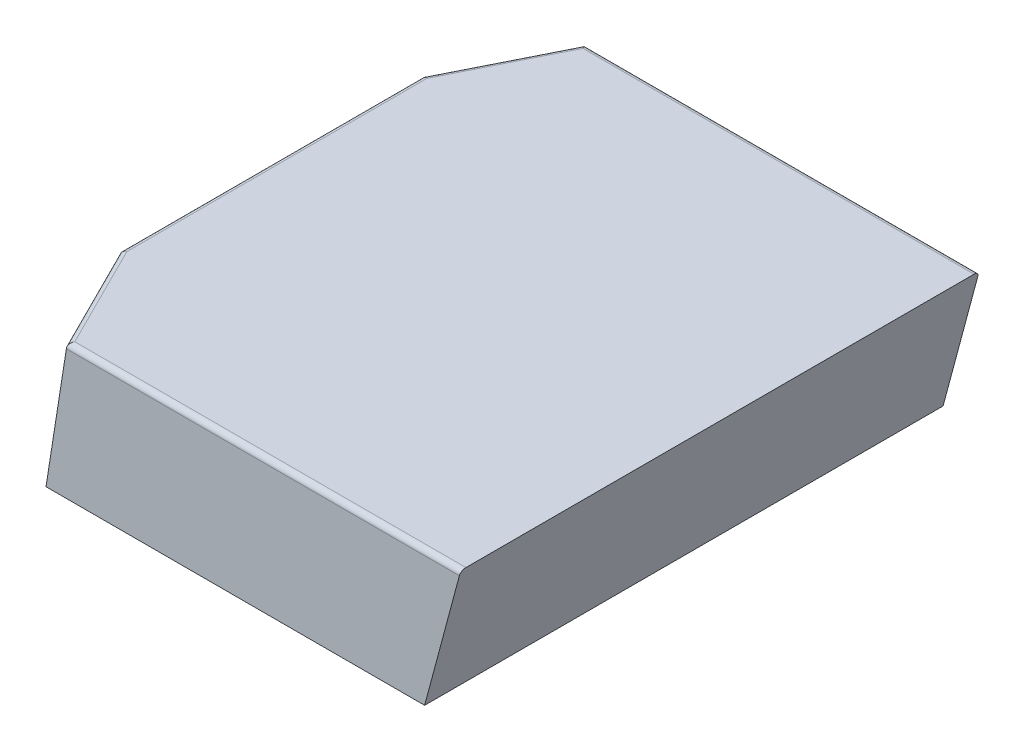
from build123d import *

# Parameters (mm, degrees)
BOSS_EXTRUDE1_DEPTH = 1000
CUT_EXTRUDE1_DEPTH  = 1371.255450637
CUT_EXTRUDE1_TAPER  = -8
CUT_EXTRUDE2_DEPTH  = 1000
FILLET1_R           = 10


with BuildPart() as part:
    # Sketch2 → Boss-Extrude1 (new body)
    with BuildSketch(Plane.XY):
        Polygon((0, 0), (900, 0), (830.333209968, -260), (0, -260), align=None)
    extrude(amount=BOSS_EXTRUDE1_DEPTH)

    # Sketch3 → Cut-Extrude1 (cut, through all)
    with BuildSketch(Plane.XZ.offset(260)):
        Polygon((0, 1000), (0, 800), (100, 1000), align=None)
        Polygon((0, 200), (0, 0), (100, 0), align=None)
    extrude(amount=-CUT_EXTRUDE1_DEPTH, taper=CUT_EXTRUDE1_TAPER, mode=Mode.SUBTRACT)

    # Sketch4 → Cut-Extrude2 (cut)
    with BuildSketch(Plane.XY.offset(1000)):
        Polygon((0, 0), (0, -260), (36.540617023, 0), align=None)
    extrude(amount=-CUT_EXTRUDE2_DEPTH, mode=Mode.SUBTRACT)

    # Fillet1
    fillet1_edges = [part.edges().sort_by_distance(p)[0] for p in [
        (520.426825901, 0, 1000),
        (88.697134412, 0, 104.313034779),
        (88.697134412, 0, 895.686965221),
        (36.540617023, 0, 500),
        (520.426825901, 0, 0),
    ]]
    fillet(fillet1_edges, radius=FILLET1_R)


solid = part.part
